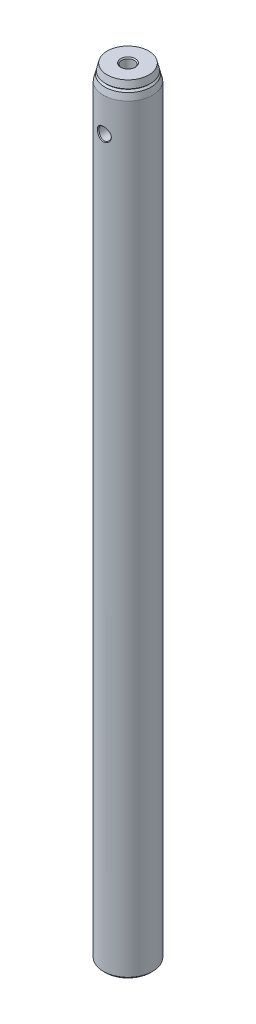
ISO-10303-21;
HEADER;
FILE_DESCRIPTION(('STEP AP214'),'2;1');
FILE_NAME('part.step','',(''),(''),'','','');
FILE_SCHEMA(('AUTOMOTIVE_DESIGN { 1 0 10303 214 1 1 1 1 }'));
ENDSEC;
DATA;
#1=APPLICATION_CONTEXT('core data for automotive mechanical design processes');
#2=APPLICATION_PROTOCOL_DEFINITION('international standard','automotive_design',2000,#1);
#3=PRODUCT_CONTEXT('',#1,'mechanical');
#4=PRODUCT('Part','Part','',(#3));
#5=PRODUCT_RELATED_PRODUCT_CATEGORY('part','',(#4));
#6=PRODUCT_DEFINITION_FORMATION('','',#4);
#7=PRODUCT_DEFINITION_CONTEXT('part definition',#1,'design');
#8=PRODUCT_DEFINITION('design','',#6,#7);
#9=PRODUCT_DEFINITION_SHAPE('','',#8);
#10=(LENGTH_UNIT() NAMED_UNIT(*) SI_UNIT(.MILLI.,.METRE.));
#11=(NAMED_UNIT(*) PLANE_ANGLE_UNIT() SI_UNIT($,.RADIAN.));
#12=(NAMED_UNIT(*) SI_UNIT($,.STERADIAN.) SOLID_ANGLE_UNIT());
#13=UNCERTAINTY_MEASURE_WITH_UNIT(LENGTH_MEASURE(1.E-05),#10,'distance_accuracy_value','');
#14=(GEOMETRIC_REPRESENTATION_CONTEXT(3) GLOBAL_UNCERTAINTY_ASSIGNED_CONTEXT((#13)) GLOBAL_UNIT_ASSIGNED_CONTEXT((#10,
#11,#12)) REPRESENTATION_CONTEXT('',''));
#15=CARTESIAN_POINT('',(0.,0.,0.));
#16=DIRECTION('',(0.,0.,1.));
#17=DIRECTION('',(1.,0.,0.));
#18=AXIS2_PLACEMENT_3D('',#15,#16,#17);
#19=CARTESIAN_POINT('',(0.,199.9996,0.));
#20=DIRECTION('',(0.,-1.,0.));
#21=DIRECTION('',(0.,0.,-1.));
#22=AXIS2_PLACEMENT_3D('',#19,#20,#21);
#23=PLANE('',#22);
#24=CARTESIAN_POINT('',(0.,199.9996,0.));
#25=DIRECTION('',(0.,-1.,0.));
#26=DIRECTION('',(0.,0.,-1.));
#27=AXIS2_PLACEMENT_3D('',#24,#25,#26);
#28=CIRCLE('',#27,1.90399999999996);
#29=CARTESIAN_POINT('',(0.,199.9996,-1.90399999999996));
#30=VERTEX_POINT('',#29);
#31=EDGE_CURVE('E11',#30,#30,#28,.T.);
#32=ORIENTED_EDGE('',*,*,#31,.T.);
#33=EDGE_LOOP('',(#32));
#34=FACE_BOUND('',#33,.T.);
#35=CARTESIAN_POINT('',(0.,199.9996,0.));
#36=DIRECTION('',(0.,1.,0.));
#37=DIRECTION('',(0.,0.,1.));
#38=AXIS2_PLACEMENT_3D('',#35,#36,#37);
#39=CIRCLE('',#38,5.34669999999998);
#40=CARTESIAN_POINT('',(0.,199.9996,5.34669999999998));
#41=VERTEX_POINT('',#40);
#42=EDGE_CURVE('E64',#41,#41,#39,.T.);
#43=ORIENTED_EDGE('',*,*,#42,.T.);
#44=EDGE_LOOP('',(#43));
#45=FACE_BOUND('',#44,.T.);
#46=ADVANCED_FACE('F17',(#34,#45),#23,.F.);
#47=CARTESIAN_POINT('',(0.,198.289290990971,0.));
#48=DIRECTION('',(0.,-1.,0.));
#49=DIRECTION('',(0.,0.,-1.));
#50=AXIS2_PLACEMENT_3D('',#47,#48,#49);
#51=CONICAL_SURFACE('',#50,5.76886488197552,0.24199804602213);
#52=ORIENTED_EDGE('',*,*,#42,.F.);
#53=EDGE_LOOP('',(#52));
#54=FACE_BOUND('',#53,.T.);
#55=CARTESIAN_POINT('',(0.,198.289290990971,0.));
#56=DIRECTION('',(0.,1.,0.));
#57=DIRECTION('',(0.,0.,1.));
#58=AXIS2_PLACEMENT_3D('',#55,#56,#57);
#59=CIRCLE('',#58,5.76886488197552);
#60=CARTESIAN_POINT('',(0.,198.289290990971,5.76886488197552));
#61=VERTEX_POINT('',#60);
#62=EDGE_CURVE('E61',#61,#61,#59,.T.);
#63=ORIENTED_EDGE('',*,*,#62,.T.);
#64=EDGE_LOOP('',(#63));
#65=FACE_BOUND('',#64,.T.);
#66=ADVANCED_FACE('F216',(#54,#65),#51,.T.);
#67=CARTESIAN_POINT('',(0.,198.00062,0.));
#68=DIRECTION('',(0.,1.,0.));
#69=DIRECTION('',(0.,0.,1.));
#70=AXIS2_PLACEMENT_3D('',#67,#68,#69);
#71=CONICAL_SURFACE('',#70,5.49909999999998,0.751555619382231);
#72=ORIENTED_EDGE('',*,*,#62,.F.);
#73=EDGE_LOOP('',(#72));
#74=FACE_BOUND('',#73,.T.);
#75=CARTESIAN_POINT('',(0.,198.00062,0.));
#76=DIRECTION('',(0.,1.,0.));
#77=DIRECTION('',(0.,0.,1.));
#78=AXIS2_PLACEMENT_3D('',#75,#76,#77);
#79=CIRCLE('',#78,5.49909999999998);
#80=CARTESIAN_POINT('',(0.,198.00062,5.49909999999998));
#81=VERTEX_POINT('',#80);
#82=EDGE_CURVE('E58',#81,#81,#79,.T.);
#83=ORIENTED_EDGE('',*,*,#82,.T.);
#84=EDGE_LOOP('',(#83));
#85=FACE_BOUND('',#84,.T.);
#86=ADVANCED_FACE('F223',(#74,#85),#71,.T.);
#87=CARTESIAN_POINT('',(0.,197.586383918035,0.));
#88=DIRECTION('',(0.,-1.,0.));
#89=DIRECTION('',(0.,0.,-1.));
#90=AXIS2_PLACEMENT_3D('',#87,#88,#89);
#91=CONICAL_SURFACE('',#90,5.9423672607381,0.819240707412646);
#92=ORIENTED_EDGE('',*,*,#82,.F.);
#93=EDGE_LOOP('',(#92));
#94=FACE_BOUND('',#93,.T.);
#95=CARTESIAN_POINT('',(0.,197.586383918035,0.));
#96=DIRECTION('',(0.,1.,0.));
#97=DIRECTION('',(0.,0.,1.));
#98=AXIS2_PLACEMENT_3D('',#95,#96,#97);
#99=CIRCLE('',#98,5.9423672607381);
#100=CARTESIAN_POINT('',(0.,197.586383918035,5.9423672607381));
#101=VERTEX_POINT('',#100);
#102=EDGE_CURVE('E55',#101,#101,#99,.T.);
#103=ORIENTED_EDGE('',*,*,#102,.T.);
#104=EDGE_LOOP('',(#103));
#105=FACE_BOUND('',#104,.T.);
#106=ADVANCED_FACE('F232',(#94,#105),#91,.T.);
#107=CARTESIAN_POINT('',(0.,195.9864,0.));
#108=DIRECTION('',(0.,-1.,0.));
#109=DIRECTION('',(0.,0.,-1.));
#110=AXIS2_PLACEMENT_3D('',#107,#108,#109);
#111=CONICAL_SURFACE('',#110,6.33729999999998,0.241998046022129);
#112=ORIENTED_EDGE('',*,*,#102,.F.);
#113=EDGE_LOOP('',(#112));
#114=FACE_BOUND('',#113,.T.);
#115=CARTESIAN_POINT('',(0.,195.9864,0.));
#116=DIRECTION('',(0.,1.,0.));
#117=DIRECTION('',(0.,0.,1.));
#118=AXIS2_PLACEMENT_3D('',#115,#116,#117);
#119=CIRCLE('',#118,6.33729999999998);
#120=CARTESIAN_POINT('',(0.,195.9864,6.33729999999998));
#121=VERTEX_POINT('',#120);
#122=EDGE_CURVE('E52',#121,#121,#119,.T.);
#123=ORIENTED_EDGE('',*,*,#122,.T.);
#124=EDGE_LOOP('',(#123));
#125=FACE_BOUND('',#124,.T.);
#126=ADVANCED_FACE('F89',(#114,#125),#111,.T.);
#127=CARTESIAN_POINT('',(0.,199.9996,0.));
#128=DIRECTION('',(0.,1.,0.));
#129=DIRECTION('',(0.,0.,1.));
#130=AXIS2_PLACEMENT_3D('',#127,#128,#129);
#131=CYLINDRICAL_SURFACE('',#130,6.33729999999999);
#132=CARTESIAN_POINT('',(0.,185.571551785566,6.33729999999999));
#133=CARTESIAN_POINT('',(0.0294399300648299,185.571535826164,6.33730404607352));
#134=CARTESIAN_POINT('',(0.058878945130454,185.572254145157,6.33707764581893));
#135=CARTESIAN_POINT('',(0.117621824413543,185.575134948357,6.33618719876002));
#136=CARTESIAN_POINT('',(0.146925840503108,185.577294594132,6.33552401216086));
#137=CARTESIAN_POINT('',(0.205337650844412,185.583029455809,6.33378438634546));
#138=CARTESIAN_POINT('',(0.234445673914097,185.586602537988,6.33270857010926));
#139=CARTESIAN_POINT('',(0.292405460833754,185.595135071,6.33016829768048));
#140=CARTESIAN_POINT('',(0.321257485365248,185.600092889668,6.32870429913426));
#141=CARTESIAN_POINT('',(0.378645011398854,185.611366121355,6.32541212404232));
#142=CARTESIAN_POINT('',(0.407180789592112,185.617680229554,6.32358429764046));
#143=CARTESIAN_POINT('',(0.463875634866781,185.631637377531,6.31958889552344));
#144=CARTESIAN_POINT('',(0.492034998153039,185.639279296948,6.31742160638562));
#145=CARTESIAN_POINT('',(0.547916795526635,185.655863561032,6.31277166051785));
#146=CARTESIAN_POINT('',(0.575639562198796,185.664804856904,6.31028925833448));
#147=CARTESIAN_POINT('',(0.630587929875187,185.6839594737,6.30503343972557));
#148=CARTESIAN_POINT('',(0.657813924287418,185.694171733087,6.30226026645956));
#149=CARTESIAN_POINT('',(0.711708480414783,185.715839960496,6.29644724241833));
#150=CARTESIAN_POINT('',(0.738377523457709,185.727294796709,6.29340763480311));
#151=CARTESIAN_POINT('',(0.791097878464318,185.751419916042,6.28708605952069));
#152=CARTESIAN_POINT('',(0.817149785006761,185.76408896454,6.28380433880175));
#153=CARTESIAN_POINT('',(0.868575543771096,185.790614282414,6.27702288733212));
#154=CARTESIAN_POINT('',(0.893950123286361,185.804469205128,6.27352340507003));
#155=CARTESIAN_POINT('',(0.943960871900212,185.833338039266,6.26633065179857));
#156=CARTESIAN_POINT('',(0.968597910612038,185.848350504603,6.26263762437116));
#157=CARTESIAN_POINT('',(1.01707325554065,185.879506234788,6.25508249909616));
#158=CARTESIAN_POINT('',(1.04091256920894,185.895647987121,6.25122062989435));
#159=CARTESIAN_POINT('',(1.08773198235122,185.929033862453,6.24335072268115));
#160=CARTESIAN_POINT('',(1.11071320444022,185.946276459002,6.23934289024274));
#161=CARTESIAN_POINT('',(1.15575658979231,185.981836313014,6.2312107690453));
#162=CARTESIAN_POINT('',(1.17781994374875,186.000152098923,6.22708664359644));
#163=CARTESIAN_POINT('',(1.22096551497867,186.037827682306,6.21872632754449));
#164=CARTESIAN_POINT('',(1.24204891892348,186.057186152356,6.21449028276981));
#165=CARTESIAN_POINT('',(1.28317150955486,186.096917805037,6.20600685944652));
#166=CARTESIAN_POINT('',(1.30321223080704,186.117289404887,6.20175950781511));
#167=CARTESIAN_POINT('',(1.3422159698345,186.158988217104,6.19335716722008));
#168=CARTESIAN_POINT('',(1.36118083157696,186.180313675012,6.18920202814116));
#169=CARTESIAN_POINT('',(1.39800144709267,186.223858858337,6.180991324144));
#170=CARTESIAN_POINT('',(1.41585895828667,186.246077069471,6.17693560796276));
#171=CARTESIAN_POINT('',(1.45043566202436,186.291349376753,6.16895620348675));
#172=CARTESIAN_POINT('',(1.467156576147,186.314402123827,6.16503232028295));
#173=CARTESIAN_POINT('',(1.49943021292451,186.361284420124,6.15734229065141));
#174=CARTESIAN_POINT('',(1.51498466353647,186.385112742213,6.15357591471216));
#175=CARTESIAN_POINT('',(1.54489561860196,186.433487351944,6.14622841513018));
#176=CARTESIAN_POINT('',(1.55925388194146,186.458032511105,6.14264702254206));
#177=CARTESIAN_POINT('',(1.58674263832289,186.507781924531,6.13569652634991));
#178=CARTESIAN_POINT('',(1.59987492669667,186.532985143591,6.1323271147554));
#179=CARTESIAN_POINT('',(1.62488191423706,186.583991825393,6.12582774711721));
#180=CARTESIAN_POINT('',(1.63675842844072,186.609794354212,6.12269744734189));
#181=CARTESIAN_POINT('',(1.65922406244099,186.661940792,6.11670343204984));
#182=CARTESIAN_POINT('',(1.66981497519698,186.688283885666,6.11383934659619));
#183=CARTESIAN_POINT('',(1.68967964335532,186.74145257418,6.10840488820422));
#184=CARTESIAN_POINT('',(1.69895509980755,186.768277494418,6.10583413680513));
#185=CARTESIAN_POINT('',(1.71615916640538,186.822350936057,6.10101345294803));
#186=CARTESIAN_POINT('',(1.72408928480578,186.849598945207,6.09876316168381));
#187=CARTESIAN_POINT('',(1.73857307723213,186.904459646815,6.09461047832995));
#188=CARTESIAN_POINT('',(1.74512793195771,186.932072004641,6.09270778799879));
#189=CARTESIAN_POINT('',(1.75683178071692,186.987602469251,6.08927733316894));
#190=CARTESIAN_POINT('',(1.76198145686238,187.015520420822,6.08774938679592));
#191=CARTESIAN_POINT('',(1.77084554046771,187.071603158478,6.08509542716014));
#192=CARTESIAN_POINT('',(1.77455992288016,187.099767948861,6.08396942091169));
#193=CARTESIAN_POINT('',(1.78052484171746,187.156285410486,6.08214612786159));
#194=CARTESIAN_POINT('',(1.78277440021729,187.184638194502,6.08144912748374));
#195=CARTESIAN_POINT('',(1.78577903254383,187.241472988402,6.08051108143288));
#196=CARTESIAN_POINT('',(1.78653189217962,187.269955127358,6.08027071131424));
#197=CARTESIAN_POINT('',(1.78652142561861,187.326919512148,6.08027101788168));
#198=CARTESIAN_POINT('',(1.78575806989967,187.355401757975,6.08051170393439));
#199=CARTESIAN_POINT('',(1.78274505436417,187.412237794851,6.08144750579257));
#200=CARTESIAN_POINT('',(1.78049756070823,187.440591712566,6.08214195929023));
#201=CARTESIAN_POINT('',(1.77454464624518,187.497112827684,6.08395846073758));
#202=CARTESIAN_POINT('',(1.77084019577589,187.525280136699,6.08508022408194));
#203=CARTESIAN_POINT('',(1.76200373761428,187.58136972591,6.08772409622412));
#204=CARTESIAN_POINT('',(1.75687176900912,187.609292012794,6.08924619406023));
#205=CARTESIAN_POINT('',(1.74520976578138,187.664833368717,6.0926637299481));
#206=CARTESIAN_POINT('',(1.73867907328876,187.692452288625,6.09455934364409));
#207=CARTESIAN_POINT('',(1.72424904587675,187.747328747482,6.09869695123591));
#208=CARTESIAN_POINT('',(1.71634855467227,187.774585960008,6.10093923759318));
#209=CARTESIAN_POINT('',(1.6992081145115,187.828680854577,6.1057433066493));
#210=CARTESIAN_POINT('',(1.68996667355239,187.855518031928,6.10830544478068));
#211=CARTESIAN_POINT('',(1.67017337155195,187.908714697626,6.11372238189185));
#212=CARTESIAN_POINT('',(1.65961981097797,187.935073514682,6.1165775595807));
#213=CARTESIAN_POINT('',(1.6372311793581,187.98725528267,6.12255377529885));
#214=CARTESIAN_POINT('',(1.62539429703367,188.013077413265,6.12567518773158));
#215=CARTESIAN_POINT('',(1.60046784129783,188.06412760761,6.13215710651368));
#216=CARTESIAN_POINT('',(1.58737641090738,188.089354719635,6.13551796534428));
#217=CARTESIAN_POINT('',(1.55996960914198,188.139156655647,6.14245199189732));
#218=CARTESIAN_POINT('',(1.54565237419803,188.163730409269,6.14602548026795));
#219=CARTESIAN_POINT('',(1.51582269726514,188.212167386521,6.15335811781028));
#220=CARTESIAN_POINT('',(1.50030840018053,188.236029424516,6.15711755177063));
#221=CARTESIAN_POINT('',(1.46811324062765,188.282984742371,6.16479495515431));
#222=CARTESIAN_POINT('',(1.45143052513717,188.306076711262,6.1687131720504));
#223=CARTESIAN_POINT('',(1.41692747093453,188.351433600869,6.17668281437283));
#224=CARTESIAN_POINT('',(1.39910525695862,188.373697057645,6.18073445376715));
#225=CARTESIAN_POINT('',(1.36235107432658,188.417338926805,6.18893888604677));
#226=CARTESIAN_POINT('',(1.3434171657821,188.438715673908,6.19309184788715));
#227=CARTESIAN_POINT('',(1.30447161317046,188.480525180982,6.20149204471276));
#228=CARTESIAN_POINT('',(1.28445791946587,188.500955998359,6.20573944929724));
#229=CARTESIAN_POINT('',(1.24338256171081,188.540805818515,6.21422472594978));
#230=CARTESIAN_POINT('',(1.22231929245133,188.560223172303,6.21846257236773));
#231=CARTESIAN_POINT('',(1.17920582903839,188.598007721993,6.22682733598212));
#232=CARTESIAN_POINT('',(1.1571545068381,188.616373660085,6.23095411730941));
#233=CARTESIAN_POINT('',(1.11212941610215,188.652027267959,6.23909234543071));
#234=CARTESIAN_POINT('',(1.08915449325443,188.669313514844,6.2431036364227));
#235=CARTESIAN_POINT('',(1.04234247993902,188.702780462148,6.25098116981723));
#236=CARTESIAN_POINT('',(1.01850428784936,188.718959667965,6.25484721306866));
#237=CARTESIAN_POINT('',(0.970027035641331,188.750184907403,6.26241131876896));
#238=CARTESIAN_POINT('',(0.945386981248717,188.765229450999,6.26610915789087));
#239=CARTESIAN_POINT('',(0.895366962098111,188.79415772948,6.27331208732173));
#240=CARTESIAN_POINT('',(0.869986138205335,188.808040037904,6.27681693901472));
#241=CARTESIAN_POINT('',(0.818545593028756,188.834616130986,6.28360960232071));
#242=CARTESIAN_POINT('',(0.792485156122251,188.847308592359,6.28689717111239));
#243=CARTESIAN_POINT('',(0.739746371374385,188.871477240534,6.29323083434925));
#244=CARTESIAN_POINT('',(0.713067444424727,188.882952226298,6.2962766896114));
#245=CARTESIAN_POINT('',(0.659152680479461,188.90465815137,6.30210251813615));
#246=CARTESIAN_POINT('',(0.631916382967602,188.914888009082,6.30488225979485));
#247=CARTESIAN_POINT('',(0.576947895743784,188.934075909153,6.31015143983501));
#248=CARTESIAN_POINT('',(0.549215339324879,188.94303296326,6.31264065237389));
#249=CARTESIAN_POINT('',(0.493315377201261,188.959647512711,6.31730435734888));
#250=CARTESIAN_POINT('',(0.465147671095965,188.967304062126,6.31947862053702));
#251=CARTESIAN_POINT('',(0.40843847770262,188.981289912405,6.32348801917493));
#252=CARTESIAN_POINT('',(0.379896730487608,188.987618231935,6.32532290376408));
#253=CARTESIAN_POINT('',(0.322500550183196,188.998920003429,6.32862915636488));
#254=CARTESIAN_POINT('',(0.29364587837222,189.003892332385,6.33010022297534));
#255=CARTESIAN_POINT('',(0.235684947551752,189.01245464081,6.33265448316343));
#256=CARTESIAN_POINT('',(0.206578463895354,189.016043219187,6.33373728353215));
#257=CARTESIAN_POINT('',(0.14817505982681,189.021810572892,6.3354906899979));
#258=CARTESIAN_POINT('',(0.118877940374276,189.023987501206,6.33616075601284));
#259=CARTESIAN_POINT('',(0.0601542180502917,189.026904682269,6.33706445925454));
#260=CARTESIAN_POINT('',(0.0307274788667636,189.027642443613,6.33729733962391));
#261=CARTESIAN_POINT('',(-0.0281314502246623,189.027653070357,6.33730239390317));
#262=CARTESIAN_POINT('',(-0.057563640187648,189.026925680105,6.33707448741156));
#263=CARTESIAN_POINT('',(-0.116308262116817,189.024027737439,6.33618067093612));
#264=CARTESIAN_POINT('',(-0.145620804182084,189.021859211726,6.33551537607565));
#265=CARTESIAN_POINT('',(-0.20406382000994,189.016108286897,6.33377147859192));
#266=CARTESIAN_POINT('',(-0.233194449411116,189.01252733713,6.33269329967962));
#267=CARTESIAN_POINT('',(-0.291211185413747,189.003980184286,6.33014820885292));
#268=CARTESIAN_POINT('',(-0.32009746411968,188.999015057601,6.32868159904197));
#269=CARTESIAN_POINT('',(-0.377563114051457,188.987728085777,6.32538416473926));
#270=CARTESIAN_POINT('',(-0.406142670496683,188.981407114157,6.32355357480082));
#271=CARTESIAN_POINT('',(-0.462932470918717,188.967436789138,6.3195526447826));
#272=CARTESIAN_POINT('',(-0.491142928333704,188.959788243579,6.31738251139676));
#273=CARTESIAN_POINT('',(-0.547132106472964,188.943190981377,6.31272692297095));
#274=CARTESIAN_POINT('',(-0.574911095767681,188.934243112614,6.31024167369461));
#275=CARTESIAN_POINT('',(-0.629974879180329,188.915075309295,6.3049802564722));
#276=CARTESIAN_POINT('',(-0.657260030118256,188.904856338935,6.30220430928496));
#277=CARTESIAN_POINT('',(-0.71127364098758,188.883174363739,6.29638588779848));
#278=CARTESIAN_POINT('',(-0.738002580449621,188.87171248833,6.29334365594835));
#279=CARTESIAN_POINT('',(-0.790841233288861,188.847572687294,6.28701704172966));
#280=CARTESIAN_POINT('',(-0.816951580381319,188.834896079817,6.28373292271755));
#281=CARTESIAN_POINT('',(-0.868490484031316,188.808354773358,6.27694694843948));
#282=CARTESIAN_POINT('',(-0.893919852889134,188.794491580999,6.27344537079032));
#283=CARTESIAN_POINT('',(-0.944034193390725,188.765605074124,6.26624876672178));
#284=CARTESIAN_POINT('',(-0.968720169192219,188.750583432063,6.26255402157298));
#285=CARTESIAN_POINT('',(-1.01728516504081,188.719407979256,6.25499587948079));
#286=CARTESIAN_POINT('',(-1.04116537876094,188.703255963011,6.25113275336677));
#287=CARTESIAN_POINT('',(-1.0880560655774,188.669847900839,6.2432608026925));
#288=CARTESIAN_POINT('',(-1.11106789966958,188.65259370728,6.23925222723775));
#289=CARTESIAN_POINT('',(-1.15615992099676,188.617008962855,6.23111925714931));
#290=CARTESIAN_POINT('',(-1.17824158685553,188.598680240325,6.22699506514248));
#291=CARTESIAN_POINT('',(-1.22140823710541,188.560976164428,6.21863501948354));
#292=CARTESIAN_POINT('',(-1.24249474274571,188.541602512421,6.21439935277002));
#293=CARTESIAN_POINT('',(-1.28361269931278,188.501836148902,6.20591742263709));
#294=CARTESIAN_POINT('',(-1.30364583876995,188.481445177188,6.2016711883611));
#295=CARTESIAN_POINT('',(-1.34263154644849,188.439703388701,6.19327195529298));
#296=CARTESIAN_POINT('',(-1.36158588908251,188.418354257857,6.1891188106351));
#297=CARTESIAN_POINT('',(-1.39838257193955,188.374757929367,6.18091254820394));
#298=CARTESIAN_POINT('',(-1.41622659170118,188.352512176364,6.17685928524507));
#299=CARTESIAN_POINT('',(-1.45077430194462,188.307182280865,6.16888519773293));
#300=CARTESIAN_POINT('',(-1.46747963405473,188.284099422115,6.16496418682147));
#301=CARTESIAN_POINT('',(-1.49972072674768,188.23715545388,6.15728016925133));
#302=CARTESIAN_POINT('',(-1.51525814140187,188.213295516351,6.15351694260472));
#303=CARTESIAN_POINT('',(-1.54513433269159,188.164857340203,6.14617589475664));
#304=CARTESIAN_POINT('',(-1.5594748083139,188.140280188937,6.14259781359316));
#305=CARTESIAN_POINT('',(-1.5869279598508,188.090467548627,6.13565397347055));
#306=CARTESIAN_POINT('',(-1.60004239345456,188.065233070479,6.13228791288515));
#307=CARTESIAN_POINT('',(-1.62501430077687,188.014165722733,6.12579516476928));
#308=CARTESIAN_POINT('',(-1.6368735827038,187.98833378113,6.12266813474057));
#309=CARTESIAN_POINT('',(-1.65930603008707,187.936131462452,6.11668046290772));
#310=CARTESIAN_POINT('',(-1.66988102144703,187.909761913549,6.11381944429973));
#311=CARTESIAN_POINT('',(-1.68971576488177,187.856544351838,6.10839081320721));
#312=CARTESIAN_POINT('',(-1.6989773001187,187.829697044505,6.1058228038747));
#313=CARTESIAN_POINT('',(-1.71615607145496,187.775583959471,6.10100719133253));
#314=CARTESIAN_POINT('',(-1.72407495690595,187.748318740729,6.09875919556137));
#315=CARTESIAN_POINT('',(-1.73853945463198,187.693429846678,6.0946105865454));
#316=CARTESIAN_POINT('',(-1.74508645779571,187.665806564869,6.0927096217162));
#317=CARTESIAN_POINT('',(-1.75677836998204,187.610261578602,6.08928200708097));
#318=CARTESIAN_POINT('',(-1.76192425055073,187.58234009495,6.08775509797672));
#319=CARTESIAN_POINT('',(-1.77078516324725,187.526258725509,6.08510249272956));
#320=CARTESIAN_POINT('',(-1.77450054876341,187.498098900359,6.08397669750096));
#321=CARTESIAN_POINT('',(-1.78047228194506,187.441600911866,6.08215307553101));
#322=CARTESIAN_POINT('',(-1.78272812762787,187.413262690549,6.08145539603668));
#323=CARTESIAN_POINT('',(-1.78575147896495,187.356467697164,6.08051493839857));
#324=CARTESIAN_POINT('',(-1.78651735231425,187.328010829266,6.0802726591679));
#325=CARTESIAN_POINT('',(-1.7865367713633,187.271102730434,6.08026883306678));
#326=CARTESIAN_POINT('',(-1.78579064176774,187.242651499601,6.08050718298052));
#327=CARTESIAN_POINT('',(-1.78281302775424,187.18587775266,6.08143863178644));
#328=CARTESIAN_POINT('',(-1.78058377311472,187.157555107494,6.08213104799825));
#329=CARTESIAN_POINT('',(-1.77466841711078,187.101096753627,6.0839435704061));
#330=CARTESIAN_POINT('',(-1.77098334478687,187.072960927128,6.08506337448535));
#331=CARTESIAN_POINT('',(-1.76218590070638,187.016934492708,6.087703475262));
#332=CARTESIAN_POINT('',(-1.75707361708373,186.989043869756,6.08922374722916));
#333=CARTESIAN_POINT('',(-1.74545068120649,186.933565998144,6.09263775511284));
#334=CARTESIAN_POINT('',(-1.7389394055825,186.905978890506,6.09453165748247));
#335=CARTESIAN_POINT('',(-1.72454728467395,186.851166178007,6.09866596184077));
#336=CARTESIAN_POINT('',(-1.71666529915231,186.823940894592,6.1009066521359));
#337=CARTESIAN_POINT('',(-1.69956034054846,186.769909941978,6.10570763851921));
#338=CARTESIAN_POINT('',(-1.69033586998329,186.743104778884,6.10826829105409));
#339=CARTESIAN_POINT('',(-1.67057437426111,186.689972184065,6.11368235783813));
#340=CARTESIAN_POINT('',(-1.66003562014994,186.663645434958,6.1165361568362));
#341=CARTESIAN_POINT('',(-1.63767386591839,186.611527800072,6.12250970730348));
#342=CARTESIAN_POINT('',(-1.62584899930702,186.585737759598,6.1256298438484));
#343=CARTESIAN_POINT('',(-1.60094323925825,186.534751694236,6.1321092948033));
#344=CARTESIAN_POINT('',(-1.58786040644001,186.509556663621,6.13546897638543));
#345=CARTESIAN_POINT('',(-1.56046686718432,186.459818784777,6.14240072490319));
#346=CARTESIAN_POINT('',(-1.54615418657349,186.435277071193,6.14597313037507));
#347=CARTESIAN_POINT('',(-1.5163290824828,186.386904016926,6.15330367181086));
#348=CARTESIAN_POINT('',(-1.500814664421,186.363073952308,6.15706211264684));
#349=CARTESIAN_POINT('',(-1.46861415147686,186.3161823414,6.16473759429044));
#350=CARTESIAN_POINT('',(-1.45192603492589,186.293122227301,6.16865490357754));
#351=CARTESIAN_POINT('',(-1.4174063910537,186.247828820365,6.17662278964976));
#352=CARTESIAN_POINT('',(-1.39957279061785,186.22559714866,6.18067360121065));
#353=CARTESIAN_POINT('',(-1.3627897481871,186.18201825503,6.18887643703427));
#354=CARTESIAN_POINT('',(-1.34383814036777,186.160672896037,6.19302864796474));
#355=CARTESIAN_POINT('',(-1.30484939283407,186.118926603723,6.20142739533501));
#356=CARTESIAN_POINT('',(-1.28480994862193,186.098527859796,6.20567411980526));
#357=CARTESIAN_POINT('',(-1.24367802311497,186.058737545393,6.21415825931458));
#358=CARTESIAN_POINT('',(-1.22258362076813,186.039347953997,6.21839564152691));
#359=CARTESIAN_POINT('',(-1.17940611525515,186.001609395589,6.22675999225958));
#360=CARTESIAN_POINT('',(-1.15732157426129,185.983262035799,6.23088678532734));
#361=CARTESIAN_POINT('',(-1.1122276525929,185.947638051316,6.23902550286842));
#362=CARTESIAN_POINT('',(-1.0892168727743,185.930363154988,6.24303723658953));
#363=CARTESIAN_POINT('',(-1.04233151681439,185.896911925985,6.25091606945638));
#364=CARTESIAN_POINT('',(-1.01845565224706,185.880737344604,6.25478293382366));
#365=CARTESIAN_POINT('',(-0.969901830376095,185.849515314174,6.26234904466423));
#366=CARTESIAN_POINT('',(-0.945222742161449,185.834469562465,6.26604803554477));
#367=CARTESIAN_POINT('',(-0.895123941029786,185.805533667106,6.27325357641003));
#368=CARTESIAN_POINT('',(-0.869703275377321,185.791645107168,6.27675986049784));
#369=CARTESIAN_POINT('',(-0.818182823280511,185.765052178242,6.28355564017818));
#370=CARTESIAN_POINT('',(-0.79208226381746,185.752349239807,6.286844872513));
#371=CARTESIAN_POINT('',(-0.739263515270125,185.728156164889,6.29318205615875));
#372=CARTESIAN_POINT('',(-0.712544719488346,185.716667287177,6.29622975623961));
#373=CARTESIAN_POINT('',(-0.65855100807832,185.694930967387,6.30205940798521));
#374=CARTESIAN_POINT('',(-0.631275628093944,185.684684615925,6.30484112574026));
#375=CARTESIAN_POINT('',(-0.576230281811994,185.665461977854,6.31011433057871));
#376=CARTESIAN_POINT('',(-0.548459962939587,185.656486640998,6.31260560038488));
#377=CARTESIAN_POINT('',(-0.492486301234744,185.639834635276,6.31727343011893));
#378=CARTESIAN_POINT('',(-0.464282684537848,185.632158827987,6.31944978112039));
#379=CARTESIAN_POINT('',(-0.407504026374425,185.618134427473,6.32346330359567));
#380=CARTESIAN_POINT('',(-0.378928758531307,185.611786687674,6.32530025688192));
#381=CARTESIAN_POINT('',(-0.321468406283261,185.600446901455,6.32861052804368));
#382=CARTESIAN_POINT('',(-0.292583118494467,185.595455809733,6.33008358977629));
#383=CARTESIAN_POINT('',(-0.234564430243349,185.586857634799,6.33264167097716));
#384=CARTESIAN_POINT('',(-0.205430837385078,185.583251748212,6.33372635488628));
#385=CARTESIAN_POINT('',(-0.146976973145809,185.577452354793,6.335483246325));
#386=CARTESIAN_POINT('',(-0.117656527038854,185.575260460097,6.33615498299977));
#387=CARTESIAN_POINT('',(-0.0588914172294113,185.572316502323,6.33706186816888));
#388=CARTESIAN_POINT('',(-0.0294466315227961,185.571566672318,6.33729633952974));
#389=CARTESIAN_POINT('',(0.,185.571551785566,6.33729999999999));
#390=B_SPLINE_CURVE_WITH_KNOTS('',3,(#132,#133,#134,#135,#136,#137,#138,#139,#140,#141,#142,
#143,#144,#145,#146,#147,#148,#149,#150,#151,#152,#153,#154,#155,#156,#157,#158,#159,#160,#161,
#162,#163,#164,#165,#166,#167,#168,#169,#170,#171,#172,#173,#174,#175,#176,#177,#178,#179,#180,
#181,#182,#183,#184,#185,#186,#187,#188,#189,#190,#191,#192,#193,#194,#195,#196,#197,#198,#199,
#200,#201,#202,#203,#204,#205,#206,#207,#208,#209,#210,#211,#212,#213,#214,#215,#216,#217,#218,
#219,#220,#221,#222,#223,#224,#225,#226,#227,#228,#229,#230,#231,#232,#233,#234,#235,#236,#237,
#238,#239,#240,#241,#242,#243,#244,#245,#246,#247,#248,#249,#250,#251,#252,#253,#254,#255,#256,
#257,#258,#259,#260,#261,#262,#263,#264,#265,#266,#267,#268,#269,#270,#271,#272,#273,#274,#275,
#276,#277,#278,#279,#280,#281,#282,#283,#284,#285,#286,#287,#288,#289,#290,#291,#292,#293,#294,
#295,#296,#297,#298,#299,#300,#301,#302,#303,#304,#305,#306,#307,#308,#309,#310,#311,#312,#313,
#314,#315,#316,#317,#318,#319,#320,#321,#322,#323,#324,#325,#326,#327,#328,#329,#330,#331,#332,
#333,#334,#335,#336,#337,#338,#339,#340,#341,#342,#343,#344,#345,#346,#347,#348,#349,#350,#351,
#352,#353,#354,#355,#356,#357,#358,#359,#360,#361,#362,#363,#364,#365,#366,#367,#368,#369,#370,
#371,#372,#373,#374,#375,#376,#377,#378,#379,#380,#381,#382,#383,#384,#385,#386,#387,#388,#389),
.UNSPECIFIED.,.F.,.F.,(4,2,2,2,2,2,2,2,2,2,2,2,2,2,2,2,2,2,2,2,2,2,2,2,2,2,2,2,2,2,2,2,2,2,2,2,
2,2,2,2,2,2,2,2,2,2,2,2,2,2,2,2,2,2,2,2,2,2,2,2,2,2,2,2,2,2,2,2,2,2,2,2,2,2,2,2,2,2,2,2,2,2,2,2,
2,2,2,2,2,2,2,2,2,2,2,2,2,2,2,2,2,2,2,2,2,2,2,2,2,2,2,2,2,2,2,2,2,2,2,2,2,2,2,2,2,2,2,2,4),(0.,
0.0883078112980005,0.176442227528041,0.264444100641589,0.3523426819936,0.440157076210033,
0.527897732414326,0.615567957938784,0.703165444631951,0.790683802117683,0.87811409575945,
0.965446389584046,1.05267129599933,1.13978153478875,1.22677350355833,1.31364886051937,
1.40041611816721,1.48705183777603,1.5735342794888,1.65987575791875,1.7460834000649,
1.83216070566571,1.91810912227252,2.00392963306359,2.08962435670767,2.17519815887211,
2.26066027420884,2.34602593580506,2.43131800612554,2.51656859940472,2.60182068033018,
2.68712961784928,2.77256466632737,2.85800137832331,2.94331366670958,3.0285692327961,
3.11382246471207,3.19911588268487,3.28448165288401,3.36994314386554,3.4555165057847,
3.5412122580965,3.62703687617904,3.71299437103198,3.79908785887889,3.8853211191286,
3.97170013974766,4.05823464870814,4.14493962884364,4.23178154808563,4.31872527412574,
4.40578126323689,4.49295255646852,4.58023639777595,4.66762584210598,4.75511135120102,
4.84268237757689,4.93032893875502,5.01804318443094,5.10582095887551,5.19366335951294,
5.28157829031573,5.36958200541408,5.45770063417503,5.54597167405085,5.63425811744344,
5.72242066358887,5.81049297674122,5.89849699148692,5.98644447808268,6.07433863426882,
6.16217569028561,6.24994651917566,6.33763824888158,6.42523587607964,6.51272388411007,
6.60008786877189,6.68731617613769,6.77440155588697,6.86134283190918,6.94814658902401,
7.0348066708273,7.12131982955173,7.20769877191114,7.29395042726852,7.38007753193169,
7.46608022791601,7.55195767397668,7.63770966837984,7.72333828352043,7.80884951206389,
7.8942549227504,7.97957332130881,8.06483240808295,8.15007041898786,8.23533773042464,
8.32069840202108,8.40604074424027,8.49125506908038,8.57640926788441,8.66155820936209,
8.74674517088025,8.83200333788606,8.91735734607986,9.00282484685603,9.08841808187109,
9.17414545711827,9.26001311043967,9.34602646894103,9.43219179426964,9.51851771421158,
9.60501673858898,9.6917067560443,9.77856083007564,9.86554539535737,9.95266668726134,
10.039923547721,10.1273090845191,10.2148123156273,10.3024197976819,10.3901172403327,
10.4778911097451,10.5657302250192,10.6536273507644,10.7415807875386,10.8295959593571,
10.9176869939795,11.0058782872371,11.0942060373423),.UNSPECIFIED.);
#391=CARTESIAN_POINT('',(0.,185.571551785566,6.33729999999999));
#392=VERTEX_POINT('',#391);
#393=EDGE_CURVE('E135',#392,#392,#390,.F.);
#394=ORIENTED_EDGE('',*,*,#393,.T.);
#395=EDGE_LOOP('',(#394));
#396=FACE_BOUND('',#395,.T.);
#397=CARTESIAN_POINT('',(0.,189.027648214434,-6.33729999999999));
#398=CARTESIAN_POINT('',(0.0294399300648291,189.027664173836,-6.33730404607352));
#399=CARTESIAN_POINT('',(0.0588789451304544,189.026945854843,-6.33707764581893));
#400=CARTESIAN_POINT('',(0.117621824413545,189.024065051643,-6.33618719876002));
#401=CARTESIAN_POINT('',(0.146925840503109,189.021905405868,-6.33552401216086));
#402=CARTESIAN_POINT('',(0.205337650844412,189.016170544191,-6.33378438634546));
#403=CARTESIAN_POINT('',(0.234445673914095,189.012597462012,-6.33270857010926));
#404=CARTESIAN_POINT('',(0.292405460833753,189.004064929,-6.33016829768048));
#405=CARTESIAN_POINT('',(0.321257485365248,188.999107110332,-6.32870429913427));
#406=CARTESIAN_POINT('',(0.378645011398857,188.987833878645,-6.32541212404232));
#407=CARTESIAN_POINT('',(0.407180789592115,188.981519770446,-6.32358429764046));
#408=CARTESIAN_POINT('',(0.463875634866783,188.967562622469,-6.31958889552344));
#409=CARTESIAN_POINT('',(0.49203499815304,188.959920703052,-6.31742160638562));
#410=CARTESIAN_POINT('',(0.547916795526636,188.943336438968,-6.31277166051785));
#411=CARTESIAN_POINT('',(0.5756395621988,188.934395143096,-6.31028925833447));
#412=CARTESIAN_POINT('',(0.630587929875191,188.9152405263,-6.30503343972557));
#413=CARTESIAN_POINT('',(0.657813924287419,188.905028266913,-6.30226026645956));
#414=CARTESIAN_POINT('',(0.711708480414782,188.883360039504,-6.29644724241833));
#415=CARTESIAN_POINT('',(0.738377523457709,188.871905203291,-6.29340763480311));
#416=CARTESIAN_POINT('',(0.791097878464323,188.847780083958,-6.28708605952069));
#417=CARTESIAN_POINT('',(0.817149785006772,188.83511103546,-6.28380433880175));
#418=CARTESIAN_POINT('',(0.868575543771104,188.808585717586,-6.27702288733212));
#419=CARTESIAN_POINT('',(0.893950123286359,188.794730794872,-6.27352340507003));
#420=CARTESIAN_POINT('',(0.94396087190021,188.765861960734,-6.26633065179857));
#421=CARTESIAN_POINT('',(0.968597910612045,188.750849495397,-6.26263762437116));
#422=CARTESIAN_POINT('',(1.01707325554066,188.719693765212,-6.25508249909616));
#423=CARTESIAN_POINT('',(1.04091256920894,188.703552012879,-6.25122062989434));
#424=CARTESIAN_POINT('',(1.08773198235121,188.670166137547,-6.24335072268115));
#425=CARTESIAN_POINT('',(1.11071320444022,188.652923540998,-6.23934289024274));
#426=CARTESIAN_POINT('',(1.15575658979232,188.617363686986,-6.2312107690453));
#427=CARTESIAN_POINT('',(1.17781994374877,188.599047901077,-6.22708664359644));
#428=CARTESIAN_POINT('',(1.22096551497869,188.561372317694,-6.21872632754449));
#429=CARTESIAN_POINT('',(1.24204891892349,188.542013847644,-6.21449028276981));
#430=CARTESIAN_POINT('',(1.28317150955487,188.502282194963,-6.20600685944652));
#431=CARTESIAN_POINT('',(1.30321223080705,188.481910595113,-6.20175950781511));
#432=CARTESIAN_POINT('',(1.34221596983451,188.440211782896,-6.19335716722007));
#433=CARTESIAN_POINT('',(1.36118083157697,188.418886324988,-6.18920202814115));
#434=CARTESIAN_POINT('',(1.39800144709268,188.375341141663,-6.180991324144));
#435=CARTESIAN_POINT('',(1.41585895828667,188.353122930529,-6.17693560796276));
#436=CARTESIAN_POINT('',(1.45043566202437,188.307850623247,-6.16895620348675));
#437=CARTESIAN_POINT('',(1.46715657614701,188.284797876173,-6.16503232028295));
#438=CARTESIAN_POINT('',(1.49943021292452,188.237915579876,-6.15734229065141));
#439=CARTESIAN_POINT('',(1.51498466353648,188.214087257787,-6.15357591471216));
#440=CARTESIAN_POINT('',(1.54489561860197,188.165712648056,-6.14622841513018));
#441=CARTESIAN_POINT('',(1.55925388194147,188.141167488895,-6.14264702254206));
#442=CARTESIAN_POINT('',(1.5867426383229,188.091418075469,-6.1356965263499));
#443=CARTESIAN_POINT('',(1.59987492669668,188.066214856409,-6.1323271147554));
#444=CARTESIAN_POINT('',(1.62488191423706,188.015208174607,-6.12582774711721));
#445=CARTESIAN_POINT('',(1.63675842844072,187.989405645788,-6.12269744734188));
#446=CARTESIAN_POINT('',(1.65922406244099,187.937259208,-6.11670343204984));
#447=CARTESIAN_POINT('',(1.66981497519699,187.910916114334,-6.11383934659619));
#448=CARTESIAN_POINT('',(1.68967964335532,187.85774742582,-6.10840488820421));
#449=CARTESIAN_POINT('',(1.69895509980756,187.830922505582,-6.10583413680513));
#450=CARTESIAN_POINT('',(1.71615916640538,187.776849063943,-6.10101345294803));
#451=CARTESIAN_POINT('',(1.72408928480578,187.749601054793,-6.09876316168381));
#452=CARTESIAN_POINT('',(1.73857307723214,187.694740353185,-6.09461047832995));
#453=CARTESIAN_POINT('',(1.74512793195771,187.667127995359,-6.09270778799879));
#454=CARTESIAN_POINT('',(1.75683178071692,187.611597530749,-6.08927733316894));
#455=CARTESIAN_POINT('',(1.76198145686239,187.583679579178,-6.08774938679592));
#456=CARTESIAN_POINT('',(1.77084554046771,187.527596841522,-6.08509542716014));
#457=CARTESIAN_POINT('',(1.77455992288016,187.499432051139,-6.08396942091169));
#458=CARTESIAN_POINT('',(1.78052484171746,187.442914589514,-6.08214612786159));
#459=CARTESIAN_POINT('',(1.78277440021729,187.414561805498,-6.08144912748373));
#460=CARTESIAN_POINT('',(1.78577903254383,187.357727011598,-6.08051108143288));
#461=CARTESIAN_POINT('',(1.78653189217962,187.329244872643,-6.08027071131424));
#462=CARTESIAN_POINT('',(1.78652142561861,187.272280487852,-6.08027101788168));
#463=CARTESIAN_POINT('',(1.78575806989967,187.243798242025,-6.08051170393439));
#464=CARTESIAN_POINT('',(1.78274505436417,187.186962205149,-6.08144750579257));
#465=CARTESIAN_POINT('',(1.78049756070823,187.158608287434,-6.08214195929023));
#466=CARTESIAN_POINT('',(1.77454464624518,187.102087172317,-6.08395846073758));
#467=CARTESIAN_POINT('',(1.77084019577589,187.073919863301,-6.08508022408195));
#468=CARTESIAN_POINT('',(1.76200373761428,187.01783027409,-6.08772409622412));
#469=CARTESIAN_POINT('',(1.75687176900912,186.989907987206,-6.08924619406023));
#470=CARTESIAN_POINT('',(1.74520976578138,186.934366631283,-6.0926637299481));
#471=CARTESIAN_POINT('',(1.73867907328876,186.906747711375,-6.09455934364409));
#472=CARTESIAN_POINT('',(1.72424904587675,186.851871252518,-6.09869695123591));
#473=CARTESIAN_POINT('',(1.71634855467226,186.824614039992,-6.10093923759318));
#474=CARTESIAN_POINT('',(1.69920811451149,186.770519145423,-6.10574330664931));
#475=CARTESIAN_POINT('',(1.68996667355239,186.743681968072,-6.10830544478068));
#476=CARTESIAN_POINT('',(1.67017337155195,186.690485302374,-6.11372238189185));
#477=CARTESIAN_POINT('',(1.65961981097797,186.664126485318,-6.1165775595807));
#478=CARTESIAN_POINT('',(1.6372311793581,186.61194471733,-6.12255377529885));
#479=CARTESIAN_POINT('',(1.62539429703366,186.586122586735,-6.12567518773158));
#480=CARTESIAN_POINT('',(1.60046784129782,186.53507239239,-6.13215710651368));
#481=CARTESIAN_POINT('',(1.58737641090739,186.509845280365,-6.13551796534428));
#482=CARTESIAN_POINT('',(1.55996960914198,186.460043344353,-6.14245199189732));
#483=CARTESIAN_POINT('',(1.54565237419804,186.435469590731,-6.14602548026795));
#484=CARTESIAN_POINT('',(1.51582269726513,186.387032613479,-6.15335811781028));
#485=CARTESIAN_POINT('',(1.50030840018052,186.363170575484,-6.15711755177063));
#486=CARTESIAN_POINT('',(1.46811324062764,186.316215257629,-6.16479495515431));
#487=CARTESIAN_POINT('',(1.45143052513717,186.293123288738,-6.1687131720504));
#488=CARTESIAN_POINT('',(1.41692747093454,186.247766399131,-6.17668281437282));
#489=CARTESIAN_POINT('',(1.39910525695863,186.225502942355,-6.18073445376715));
#490=CARTESIAN_POINT('',(1.36235107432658,186.181861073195,-6.18893888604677));
#491=CARTESIAN_POINT('',(1.3434171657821,186.160484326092,-6.19309184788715));
#492=CARTESIAN_POINT('',(1.30447161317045,186.118674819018,-6.20149204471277));
#493=CARTESIAN_POINT('',(1.28445791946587,186.098244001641,-6.20573944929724));
#494=CARTESIAN_POINT('',(1.24338256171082,186.058394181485,-6.21422472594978));
#495=CARTESIAN_POINT('',(1.22231929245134,186.038976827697,-6.21846257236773));
#496=CARTESIAN_POINT('',(1.17920582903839,186.001192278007,-6.22682733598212));
#497=CARTESIAN_POINT('',(1.15715450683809,185.982826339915,-6.23095411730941));
#498=CARTESIAN_POINT('',(1.11212941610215,185.947172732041,-6.23909234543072));
#499=CARTESIAN_POINT('',(1.08915449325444,185.929886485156,-6.2431036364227));
#500=CARTESIAN_POINT('',(1.04234247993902,185.896419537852,-6.25098116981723));
#501=CARTESIAN_POINT('',(1.01850428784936,185.880240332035,-6.25484721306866));
#502=CARTESIAN_POINT('',(0.970027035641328,185.849015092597,-6.26241131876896));
#503=CARTESIAN_POINT('',(0.945386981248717,185.833970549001,-6.26610915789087));
#504=CARTESIAN_POINT('',(0.895366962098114,185.80504227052,-6.27331208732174));
#505=CARTESIAN_POINT('',(0.869986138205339,185.791159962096,-6.27681693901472));
#506=CARTESIAN_POINT('',(0.818545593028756,185.764583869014,-6.28360960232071));
#507=CARTESIAN_POINT('',(0.792485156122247,185.751891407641,-6.2868971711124));
#508=CARTESIAN_POINT('',(0.739746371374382,185.727722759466,-6.29323083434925));
#509=CARTESIAN_POINT('',(0.713067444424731,185.716247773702,-6.2962766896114));
#510=CARTESIAN_POINT('',(0.659152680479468,185.69454184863,-6.30210251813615));
#511=CARTESIAN_POINT('',(0.631916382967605,185.684311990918,-6.30488225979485));
#512=CARTESIAN_POINT('',(0.576947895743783,185.665124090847,-6.31015143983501));
#513=CARTESIAN_POINT('',(0.54921533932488,185.65616703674,-6.31264065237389));
#514=CARTESIAN_POINT('',(0.493315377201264,185.639552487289,-6.31730435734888));
#515=CARTESIAN_POINT('',(0.465147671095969,185.631895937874,-6.31947862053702));
#516=CARTESIAN_POINT('',(0.408438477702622,185.617910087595,-6.32348801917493));
#517=CARTESIAN_POINT('',(0.379896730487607,185.611581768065,-6.32532290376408));
#518=CARTESIAN_POINT('',(0.322500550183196,185.600279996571,-6.32862915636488));
#519=CARTESIAN_POINT('',(0.293645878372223,185.595307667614,-6.33010022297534));
#520=CARTESIAN_POINT('',(0.235684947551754,185.58674535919,-6.33265448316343));
#521=CARTESIAN_POINT('',(0.206578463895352,185.583156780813,-6.33373728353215));
#522=CARTESIAN_POINT('',(0.148175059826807,185.577389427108,-6.3354906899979));
#523=CARTESIAN_POINT('',(0.118877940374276,185.575212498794,-6.33616075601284));
#524=CARTESIAN_POINT('',(0.0601542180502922,185.572295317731,-6.33706445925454));
#525=CARTESIAN_POINT('',(0.0307274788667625,185.571557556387,-6.33729733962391));
#526=CARTESIAN_POINT('',(-0.0281314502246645,185.571546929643,-6.33730239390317));
#527=CARTESIAN_POINT('',(-0.0575636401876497,185.572274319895,-6.33707448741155));
#528=CARTESIAN_POINT('',(-0.116308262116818,185.575172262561,-6.33618067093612));
#529=CARTESIAN_POINT('',(-0.145620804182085,185.577340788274,-6.33551537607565));
#530=CARTESIAN_POINT('',(-0.204063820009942,185.583091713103,-6.33377147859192));
#531=CARTESIAN_POINT('',(-0.233194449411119,185.58667266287,-6.33269329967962));
#532=CARTESIAN_POINT('',(-0.29121118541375,185.595219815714,-6.33014820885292));
#533=CARTESIAN_POINT('',(-0.320097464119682,185.600184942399,-6.32868159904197));
#534=CARTESIAN_POINT('',(-0.37756311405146,185.611471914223,-6.32538416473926));
#535=CARTESIAN_POINT('',(-0.406142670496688,185.617792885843,-6.32355357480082));
#536=CARTESIAN_POINT('',(-0.46293247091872,185.631763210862,-6.3195526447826));
#537=CARTESIAN_POINT('',(-0.491142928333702,185.639411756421,-6.31738251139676));
#538=CARTESIAN_POINT('',(-0.54713210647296,185.656009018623,-6.31272692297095));
#539=CARTESIAN_POINT('',(-0.574911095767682,185.664956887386,-6.31024167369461));
#540=CARTESIAN_POINT('',(-0.62997487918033,185.684124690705,-6.3049802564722));
#541=CARTESIAN_POINT('',(-0.657260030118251,185.694343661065,-6.30220430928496));
#542=CARTESIAN_POINT('',(-0.711273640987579,185.716025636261,-6.29638588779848));
#543=CARTESIAN_POINT('',(-0.738002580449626,185.72748751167,-6.29334365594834));
#544=CARTESIAN_POINT('',(-0.790841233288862,185.751627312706,-6.28701704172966));
#545=CARTESIAN_POINT('',(-0.816951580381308,185.764303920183,-6.28373292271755));
#546=CARTESIAN_POINT('',(-0.868490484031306,185.790845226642,-6.27694694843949));
#547=CARTESIAN_POINT('',(-0.893919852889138,185.804708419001,-6.27344537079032));
#548=CARTESIAN_POINT('',(-0.944034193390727,185.833594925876,-6.26624876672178));
#549=CARTESIAN_POINT('',(-0.968720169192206,185.848616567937,-6.26255402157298));
#550=CARTESIAN_POINT('',(-1.0172851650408,185.879792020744,-6.25499587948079));
#551=CARTESIAN_POINT('',(-1.04116537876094,185.895944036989,-6.25113275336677));
#552=CARTESIAN_POINT('',(-1.08805606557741,185.929352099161,-6.2432608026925));
#553=CARTESIAN_POINT('',(-1.11106789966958,185.94660629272,-6.23925222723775));
#554=CARTESIAN_POINT('',(-1.15615992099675,185.982191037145,-6.23111925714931));
#555=CARTESIAN_POINT('',(-1.17824158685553,186.000519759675,-6.22699506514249));
#556=CARTESIAN_POINT('',(-1.22140823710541,186.038223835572,-6.21863501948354));
#557=CARTESIAN_POINT('',(-1.24249474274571,186.057597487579,-6.21439935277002));
#558=CARTESIAN_POINT('',(-1.28361269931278,186.097363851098,-6.20591742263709));
#559=CARTESIAN_POINT('',(-1.30364583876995,186.117754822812,-6.2016711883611));
#560=CARTESIAN_POINT('',(-1.34263154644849,186.159496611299,-6.19327195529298));
#561=CARTESIAN_POINT('',(-1.36158588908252,186.180845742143,-6.18911881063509));
#562=CARTESIAN_POINT('',(-1.39838257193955,186.224442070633,-6.18091254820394));
#563=CARTESIAN_POINT('',(-1.41622659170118,186.246687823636,-6.17685928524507));
#564=CARTESIAN_POINT('',(-1.45077430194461,186.292017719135,-6.16888519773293));
#565=CARTESIAN_POINT('',(-1.46747963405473,186.315100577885,-6.16496418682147));
#566=CARTESIAN_POINT('',(-1.49972072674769,186.36204454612,-6.15728016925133));
#567=CARTESIAN_POINT('',(-1.51525814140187,186.385904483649,-6.15351694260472));
#568=CARTESIAN_POINT('',(-1.54513433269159,186.434342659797,-6.14617589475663));
#569=CARTESIAN_POINT('',(-1.5594748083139,186.458919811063,-6.14259781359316));
#570=CARTESIAN_POINT('',(-1.5869279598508,186.508732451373,-6.13565397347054));
#571=CARTESIAN_POINT('',(-1.60004239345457,186.533966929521,-6.13228791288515));
#572=CARTESIAN_POINT('',(-1.62501430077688,186.585034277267,-6.12579516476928));
#573=CARTESIAN_POINT('',(-1.6368735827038,186.61086621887,-6.12266813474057));
#574=CARTESIAN_POINT('',(-1.65930603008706,186.663068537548,-6.11668046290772));
#575=CARTESIAN_POINT('',(-1.66988102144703,186.689438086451,-6.11381944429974));
#576=CARTESIAN_POINT('',(-1.68971576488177,186.742655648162,-6.10839081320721));
#577=CARTESIAN_POINT('',(-1.69897730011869,186.769502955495,-6.1058228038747));
#578=CARTESIAN_POINT('',(-1.71615607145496,186.823616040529,-6.10100719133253));
#579=CARTESIAN_POINT('',(-1.72407495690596,186.850881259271,-6.09875919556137));
#580=CARTESIAN_POINT('',(-1.73853945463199,186.905770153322,-6.0946105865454));
#581=CARTESIAN_POINT('',(-1.74508645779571,186.933393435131,-6.0927096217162));
#582=CARTESIAN_POINT('',(-1.75677836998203,186.988938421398,-6.08928200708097));
#583=CARTESIAN_POINT('',(-1.76192425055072,187.01685990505,-6.08775509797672));
#584=CARTESIAN_POINT('',(-1.77078516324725,187.072941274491,-6.08510249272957));
#585=CARTESIAN_POINT('',(-1.77450054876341,187.101101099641,-6.08397669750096));
#586=CARTESIAN_POINT('',(-1.78047228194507,187.157599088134,-6.08215307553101));
#587=CARTESIAN_POINT('',(-1.78272812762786,187.185937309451,-6.08145539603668));
#588=CARTESIAN_POINT('',(-1.78575147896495,187.242732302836,-6.08051493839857));
#589=CARTESIAN_POINT('',(-1.78651735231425,187.271189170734,-6.0802726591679));
#590=CARTESIAN_POINT('',(-1.7865367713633,187.328097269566,-6.08026883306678));
#591=CARTESIAN_POINT('',(-1.78579064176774,187.356548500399,-6.08050718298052));
#592=CARTESIAN_POINT('',(-1.78281302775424,187.41332224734,-6.08143863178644));
#593=CARTESIAN_POINT('',(-1.78058377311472,187.441644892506,-6.08213104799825));
#594=CARTESIAN_POINT('',(-1.77466841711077,187.498103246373,-6.0839435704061));
#595=CARTESIAN_POINT('',(-1.77098334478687,187.526239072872,-6.08506337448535));
#596=CARTESIAN_POINT('',(-1.76218590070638,187.582265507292,-6.087703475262));
#597=CARTESIAN_POINT('',(-1.75707361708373,187.610156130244,-6.08922374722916));
#598=CARTESIAN_POINT('',(-1.74545068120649,187.665634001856,-6.09263775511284));
#599=CARTESIAN_POINT('',(-1.7389394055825,187.693221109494,-6.09453165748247));
#600=CARTESIAN_POINT('',(-1.72454728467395,187.748033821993,-6.09866596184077));
#601=CARTESIAN_POINT('',(-1.71666529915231,187.775259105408,-6.1009066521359));
#602=CARTESIAN_POINT('',(-1.69956034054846,187.829290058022,-6.10570763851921));
#603=CARTESIAN_POINT('',(-1.6903358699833,187.856095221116,-6.10826829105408));
#604=CARTESIAN_POINT('',(-1.67057437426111,187.909227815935,-6.11368235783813));
#605=CARTESIAN_POINT('',(-1.66003562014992,187.935554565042,-6.11653615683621));
#606=CARTESIAN_POINT('',(-1.63767386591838,187.987672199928,-6.12250970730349));
#607=CARTESIAN_POINT('',(-1.62584899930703,188.013462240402,-6.1256298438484));
#608=CARTESIAN_POINT('',(-1.60094323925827,188.064448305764,-6.1321092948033));
#609=CARTESIAN_POINT('',(-1.58786040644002,188.089643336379,-6.13546897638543));
#610=CARTESIAN_POINT('',(-1.56046686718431,188.139381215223,-6.14240072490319));
#611=CARTESIAN_POINT('',(-1.54615418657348,188.163922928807,-6.14597313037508));
#612=CARTESIAN_POINT('',(-1.51632908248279,188.212295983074,-6.15330367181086));
#613=CARTESIAN_POINT('',(-1.500814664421,188.236126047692,-6.15706211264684));
#614=CARTESIAN_POINT('',(-1.46861415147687,188.2830176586,-6.16473759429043));
#615=CARTESIAN_POINT('',(-1.4519260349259,188.306077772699,-6.16865490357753));
#616=CARTESIAN_POINT('',(-1.4174063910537,188.351371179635,-6.17662278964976));
#617=CARTESIAN_POINT('',(-1.39957279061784,188.37360285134,-6.18067360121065));
#618=CARTESIAN_POINT('',(-1.3627897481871,188.41718174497,-6.18887643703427));
#619=CARTESIAN_POINT('',(-1.34383814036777,188.438527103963,-6.19302864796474));
#620=CARTESIAN_POINT('',(-1.30484939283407,188.480273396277,-6.20142739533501));
#621=CARTESIAN_POINT('',(-1.28480994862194,188.500672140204,-6.20567411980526));
#622=CARTESIAN_POINT('',(-1.24367802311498,188.540462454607,-6.21415825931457));
#623=CARTESIAN_POINT('',(-1.22258362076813,188.559852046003,-6.21839564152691));
#624=CARTESIAN_POINT('',(-1.17940611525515,188.597590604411,-6.22675999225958));
#625=CARTESIAN_POINT('',(-1.1573215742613,188.615937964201,-6.23088678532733));
#626=CARTESIAN_POINT('',(-1.11222765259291,188.651561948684,-6.23902550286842));
#627=CARTESIAN_POINT('',(-1.08921687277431,188.668836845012,-6.24303723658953));
#628=CARTESIAN_POINT('',(-1.04233151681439,188.702288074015,-6.25091606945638));
#629=CARTESIAN_POINT('',(-1.01845565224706,188.718462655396,-6.25478293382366));
#630=CARTESIAN_POINT('',(-0.969901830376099,188.749684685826,-6.26234904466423));
#631=CARTESIAN_POINT('',(-0.945222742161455,188.764730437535,-6.26604803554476));
#632=CARTESIAN_POINT('',(-0.895123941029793,188.793666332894,-6.27325357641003));
#633=CARTESIAN_POINT('',(-0.869703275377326,188.807554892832,-6.27675986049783));
#634=CARTESIAN_POINT('',(-0.818182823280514,188.834147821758,-6.28355564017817));
#635=CARTESIAN_POINT('',(-0.792082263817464,188.846850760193,-6.28684487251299));
#636=CARTESIAN_POINT('',(-0.739263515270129,188.871043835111,-6.29318205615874));
#637=CARTESIAN_POINT('',(-0.71254471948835,188.882532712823,-6.29622975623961));
#638=CARTESIAN_POINT('',(-0.658551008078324,188.904269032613,-6.30205940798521));
#639=CARTESIAN_POINT('',(-0.631275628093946,188.914515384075,-6.30484112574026));
#640=CARTESIAN_POINT('',(-0.576230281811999,188.933738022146,-6.31011433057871));
#641=CARTESIAN_POINT('',(-0.548459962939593,188.942713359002,-6.31260560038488));
#642=CARTESIAN_POINT('',(-0.492486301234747,188.959365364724,-6.31727343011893));
#643=CARTESIAN_POINT('',(-0.464282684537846,188.967041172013,-6.31944978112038));
#644=CARTESIAN_POINT('',(-0.407504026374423,188.981065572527,-6.32346330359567));
#645=CARTESIAN_POINT('',(-0.378928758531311,188.987413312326,-6.32530025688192));
#646=CARTESIAN_POINT('',(-0.321468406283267,188.998753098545,-6.32861052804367));
#647=CARTESIAN_POINT('',(-0.292583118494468,189.003744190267,-6.33008358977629));
#648=CARTESIAN_POINT('',(-0.234564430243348,189.012342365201,-6.33264167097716));
#649=CARTESIAN_POINT('',(-0.205430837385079,189.015948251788,-6.33372635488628));
#650=CARTESIAN_POINT('',(-0.146976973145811,189.021747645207,-6.335483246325));
#651=CARTESIAN_POINT('',(-0.117656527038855,189.023939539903,-6.33615498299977));
#652=CARTESIAN_POINT('',(-0.0588914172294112,189.026883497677,-6.33706186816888));
#653=CARTESIAN_POINT('',(-0.0294466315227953,189.027633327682,-6.33729633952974));
#654=CARTESIAN_POINT('',(0.,189.027648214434,-6.33729999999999));
#655=B_SPLINE_CURVE_WITH_KNOTS('',3,(#397,#398,#399,#400,#401,#402,#403,#404,#405,#406,#407,
#408,#409,#410,#411,#412,#413,#414,#415,#416,#417,#418,#419,#420,#421,#422,#423,#424,#425,#426,
#427,#428,#429,#430,#431,#432,#433,#434,#435,#436,#437,#438,#439,#440,#441,#442,#443,#444,#445,
#446,#447,#448,#449,#450,#451,#452,#453,#454,#455,#456,#457,#458,#459,#460,#461,#462,#463,#464,
#465,#466,#467,#468,#469,#470,#471,#472,#473,#474,#475,#476,#477,#478,#479,#480,#481,#482,#483,
#484,#485,#486,#487,#488,#489,#490,#491,#492,#493,#494,#495,#496,#497,#498,#499,#500,#501,#502,
#503,#504,#505,#506,#507,#508,#509,#510,#511,#512,#513,#514,#515,#516,#517,#518,#519,#520,#521,
#522,#523,#524,#525,#526,#527,#528,#529,#530,#531,#532,#533,#534,#535,#536,#537,#538,#539,#540,
#541,#542,#543,#544,#545,#546,#547,#548,#549,#550,#551,#552,#553,#554,#555,#556,#557,#558,#559,
#560,#561,#562,#563,#564,#565,#566,#567,#568,#569,#570,#571,#572,#573,#574,#575,#576,#577,#578,
#579,#580,#581,#582,#583,#584,#585,#586,#587,#588,#589,#590,#591,#592,#593,#594,#595,#596,#597,
#598,#599,#600,#601,#602,#603,#604,#605,#606,#607,#608,#609,#610,#611,#612,#613,#614,#615,#616,
#617,#618,#619,#620,#621,#622,#623,#624,#625,#626,#627,#628,#629,#630,#631,#632,#633,#634,#635,
#636,#637,#638,#639,#640,#641,#642,#643,#644,#645,#646,#647,#648,#649,#650,#651,#652,#653,#654),
.UNSPECIFIED.,.F.,.F.,(4,2,2,2,2,2,2,2,2,2,2,2,2,2,2,2,2,2,2,2,2,2,2,2,2,2,2,2,2,2,2,2,2,2,2,2,
2,2,2,2,2,2,2,2,2,2,2,2,2,2,2,2,2,2,2,2,2,2,2,2,2,2,2,2,2,2,2,2,2,2,2,2,2,2,2,2,2,2,2,2,2,2,2,2,
2,2,2,2,2,2,2,2,2,2,2,2,2,2,2,2,2,2,2,2,2,2,2,2,2,2,2,2,2,2,2,2,2,2,2,2,2,2,2,2,2,2,2,2,4),(0.,
0.0883078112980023,0.176442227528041,0.264444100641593,0.352342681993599,0.440157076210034,
0.527897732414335,0.615567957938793,0.703165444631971,0.790683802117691,0.878114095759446,
0.965446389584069,1.05267129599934,1.13978153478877,1.22677350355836,1.31364886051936,
1.40041611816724,1.48705183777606,1.57353427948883,1.65987575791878,1.74608340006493,
1.83216070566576,1.91810912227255,2.00392963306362,2.0896243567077,2.17519815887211,
2.26066027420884,2.34602593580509,2.43131800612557,2.51656859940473,2.60182068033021,
2.68712961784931,2.77256466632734,2.85800137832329,2.94331366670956,3.02856923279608,
3.11382246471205,3.19911588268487,3.28448165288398,3.36994314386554,3.45551650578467,
3.54121225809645,3.62703687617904,3.71299437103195,3.79908785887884,3.88532111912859,
3.97170013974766,4.05823464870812,4.14493962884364,4.23178154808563,4.31872527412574,
4.4057812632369,4.49295255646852,4.58023639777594,4.66762584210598,4.75511135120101,
4.84268237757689,4.93032893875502,5.01804318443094,5.10582095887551,5.19366335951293,
5.28157829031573,5.36958200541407,5.45770063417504,5.54597167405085,5.63425811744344,
5.72242066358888,5.81049297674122,5.89849699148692,5.98644447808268,6.07433863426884,
6.16217569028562,6.24994651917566,6.33763824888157,6.42523587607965,6.51272388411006,
6.60008786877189,6.68731617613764,6.77440155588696,6.86134283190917,6.948146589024,
7.03480667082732,7.12131982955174,7.20769877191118,7.29395042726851,7.38007753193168,
7.46608022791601,7.55195767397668,7.63770966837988,7.72333828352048,7.80884951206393,
7.89425492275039,7.97957332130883,8.06483240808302,8.15007041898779,8.23533773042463,
8.32069840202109,8.40604074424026,8.49125506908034,8.57640926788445,8.66155820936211,
8.74674517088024,8.83200333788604,8.91735734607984,9.00282484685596,9.08841808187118,
9.17414545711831,9.26001311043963,9.34602646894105,9.43219179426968,9.51851771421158,
9.60501673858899,9.69170675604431,9.77856083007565,9.8655453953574,9.95266668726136,
10.039923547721,10.1273090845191,10.2148123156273,10.3024197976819,10.3901172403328,
10.4778911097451,10.5657302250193,10.6536273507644,10.7415807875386,10.8295959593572,
10.9176869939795,11.0058782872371,11.0942060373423),.UNSPECIFIED.);
#656=CARTESIAN_POINT('',(0.,189.027648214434,-6.33729999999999));
#657=VERTEX_POINT('',#656);
#658=EDGE_CURVE('E67',#657,#657,#655,.F.);
#659=ORIENTED_EDGE('',*,*,#658,.T.);
#660=EDGE_LOOP('',(#659));
#661=FACE_BOUND('',#660,.T.);
#662=ORIENTED_EDGE('',*,*,#122,.F.);
#663=EDGE_LOOP('',(#662));
#664=FACE_BOUND('',#663,.T.);
#665=CARTESIAN_POINT('',(0.,0.508000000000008,0.));
#666=DIRECTION('',(0.,1.,0.));
#667=DIRECTION('',(0.,0.,1.));
#668=AXIS2_PLACEMENT_3D('',#665,#666,#667);
#669=CIRCLE('',#668,6.3373);
#670=CARTESIAN_POINT('',(0.,0.508000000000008,6.3373));
#671=VERTEX_POINT('',#670);
#672=EDGE_CURVE('E49',#671,#671,#669,.T.);
#673=ORIENTED_EDGE('',*,*,#672,.T.);
#674=EDGE_LOOP('',(#673));
#675=FACE_BOUND('',#674,.T.);
#676=ADVANCED_FACE('F78',(#396,#661,#664,#675),#131,.T.);
#677=CARTESIAN_POINT('',(0.,0.,0.));
#678=DIRECTION('',(0.,1.,0.));
#679=DIRECTION('',(0.,0.,1.));
#680=AXIS2_PLACEMENT_3D('',#677,#678,#679);
#681=CONICAL_SURFACE('',#680,5.8293,0.78539816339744);
#682=ORIENTED_EDGE('',*,*,#672,.F.);
#683=EDGE_LOOP('',(#682));
#684=FACE_BOUND('',#683,.T.);
#685=CARTESIAN_POINT('',(0.,0.,0.));
#686=DIRECTION('',(0.,1.,0.));
#687=DIRECTION('',(0.,0.,1.));
#688=AXIS2_PLACEMENT_3D('',#685,#686,#687);
#689=CIRCLE('',#688,5.8293);
#690=CARTESIAN_POINT('',(0.,0.,5.8293));
#691=VERTEX_POINT('',#690);
#692=EDGE_CURVE('E44',#691,#691,#689,.T.);
#693=ORIENTED_EDGE('',*,*,#692,.T.);
#694=EDGE_LOOP('',(#693));
#695=FACE_BOUND('',#694,.T.);
#696=ADVANCED_FACE('F88',(#684,#695),#681,.T.);
#697=CARTESIAN_POINT('',(5.82930000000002,0.,0.));
#698=DIRECTION('',(0.,1.,0.));
#699=DIRECTION('',(0.,0.,1.));
#700=AXIS2_PLACEMENT_3D('',#697,#698,#699);
#701=PLANE('',#700);
#702=CARTESIAN_POINT('',(0.,0.,0.));
#703=DIRECTION('',(0.,1.,0.));
#704=DIRECTION('',(0.,0.,1.));
#705=AXIS2_PLACEMENT_3D('',#702,#703,#704);
#706=CIRCLE('',#705,3.00800000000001);
#707=CARTESIAN_POINT('',(0.,0.,3.00800000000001));
#708=VERTEX_POINT('',#707);
#709=EDGE_CURVE('E196',#708,#708,#706,.T.);
#710=ORIENTED_EDGE('',*,*,#709,.T.);
#711=EDGE_LOOP('',(#710));
#712=FACE_BOUND('',#711,.T.);
#713=ORIENTED_EDGE('',*,*,#692,.F.);
#714=EDGE_LOOP('',(#713));
#715=FACE_BOUND('',#714,.T.);
#716=ADVANCED_FACE('F249',(#712,#715),#701,.F.);
#717=CARTESIAN_POINT('',(0.,199.9996,0.));
#718=DIRECTION('',(0.,1.,0.));
#719=DIRECTION('',(0.,0.,1.));
#720=AXIS2_PLACEMENT_3D('',#717,#718,#719);
#721=CYLINDRICAL_SURFACE('',#720,1.65);
#722=CARTESIAN_POINT('',(0.,199.7456,0.));
#723=DIRECTION('',(0.,-1.,0.));
#724=DIRECTION('',(0.,0.,-1.));
#725=AXIS2_PLACEMENT_3D('',#722,#723,#724);
#726=CIRCLE('',#725,1.65);
#727=CARTESIAN_POINT('',(0.,199.7456,-1.65));
#728=VERTEX_POINT('',#727);
#729=EDGE_CURVE('E25',#728,#728,#726,.F.);
#730=ORIENTED_EDGE('',*,*,#729,.T.);
#731=EDGE_LOOP('',(#730));
#732=FACE_BOUND('',#731,.T.);
#733=CARTESIAN_POINT('',(0.,193.9036,0.));
#734=DIRECTION('',(0.,1.,0.));
#735=DIRECTION('',(0.,0.,1.));
#736=AXIS2_PLACEMENT_3D('',#733,#734,#735);
#737=CIRCLE('',#736,1.65);
#738=CARTESIAN_POINT('',(0.,193.9036,1.65));
#739=VERTEX_POINT('',#738);
#740=EDGE_CURVE('E41',#739,#739,#737,.T.);
#741=ORIENTED_EDGE('',*,*,#740,.F.);
#742=EDGE_LOOP('',(#741));
#743=FACE_BOUND('',#742,.T.);
#744=ADVANCED_FACE('F202',(#732,#743),#721,.F.);
#745=CARTESIAN_POINT('',(0.,193.9036,0.));
#746=DIRECTION('',(0.,1.,0.));
#747=DIRECTION('',(0.,0.,1.));
#748=AXIS2_PLACEMENT_3D('',#745,#746,#747);
#749=CONICAL_SURFACE('',#748,1.65,1.02974425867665);
#750=CARTESIAN_POINT('',(0.,192.912179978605,0.));
#751=VERTEX_POINT('',#750);
#752=VERTEX_LOOP('',#751);
#753=FACE_BOUND('',#752,.T.);
#754=ORIENTED_EDGE('',*,*,#740,.T.);
#755=EDGE_LOOP('',(#754));
#756=FACE_BOUND('',#755,.T.);
#757=ADVANCED_FACE('F258',(#753,#756),#749,.F.);
#758=CARTESIAN_POINT('',(0.,0.,0.));
#759=DIRECTION('',(0.,-1.,0.));
#760=DIRECTION('',(0.,0.,-1.));
#761=AXIS2_PLACEMENT_3D('',#758,#759,#760);
#762=CYLINDRICAL_SURFACE('',#761,2.5);
#763=CARTESIAN_POINT('',(0.,0.508000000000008,0.));
#764=DIRECTION('',(0.,1.,0.));
#765=DIRECTION('',(0.,0.,1.));
#766=AXIS2_PLACEMENT_3D('',#763,#764,#765);
#767=CIRCLE('',#766,2.5);
#768=CARTESIAN_POINT('',(0.,0.508000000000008,2.5));
#769=VERTEX_POINT('',#768);
#770=EDGE_CURVE('E188',#769,#769,#767,.F.);
#771=ORIENTED_EDGE('',*,*,#770,.T.);
#772=EDGE_LOOP('',(#771));
#773=FACE_BOUND('',#772,.T.);
#774=CARTESIAN_POINT('',(0.,10.541,0.));
#775=DIRECTION('',(0.,-1.,0.));
#776=DIRECTION('',(0.,0.,-1.));
#777=AXIS2_PLACEMENT_3D('',#774,#775,#776);
#778=CIRCLE('',#777,2.5);
#779=CARTESIAN_POINT('',(0.,10.541,-2.5));
#780=VERTEX_POINT('',#779);
#781=EDGE_CURVE('E39',#780,#780,#778,.T.);
#782=ORIENTED_EDGE('',*,*,#781,.F.);
#783=EDGE_LOOP('',(#782));
#784=FACE_BOUND('',#783,.T.);
#785=ADVANCED_FACE('F35',(#773,#784),#762,.F.);
#786=CARTESIAN_POINT('',(0.,10.541,0.));
#787=DIRECTION('',(0.,-1.,0.));
#788=DIRECTION('',(0.,0.,-1.));
#789=AXIS2_PLACEMENT_3D('',#786,#787,#788);
#790=CONICAL_SURFACE('',#789,2.5,1.02974425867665);
#791=CARTESIAN_POINT('',(0.,12.0431515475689,0.));
#792=VERTEX_POINT('',#791);
#793=VERTEX_LOOP('',#792);
#794=FACE_BOUND('',#793,.T.);
#795=ORIENTED_EDGE('',*,*,#781,.T.);
#796=EDGE_LOOP('',(#795));
#797=FACE_BOUND('',#796,.T.);
#798=ADVANCED_FACE('F31',(#794,#797),#790,.F.);
#799=CARTESIAN_POINT('',(0.,187.2996,-6.3373));
#800=DIRECTION('',(0.,0.,1.));
#801=DIRECTION('',(1.,0.,0.));
#802=AXIS2_PLACEMENT_3D('',#799,#800,#801);
#803=CYLINDRICAL_SURFACE('',#802,1.5875);
#804=CARTESIAN_POINT('',(0.,185.7121,6.12985953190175));
#805=CARTESIAN_POINT('',(-0.419045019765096,185.712326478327,6.129800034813));
#806=CARTESIAN_POINT('',(-0.83097660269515,185.885476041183,6.07257117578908));
#807=CARTESIAN_POINT('',(-1.41586111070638,186.470435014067,5.94071188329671));
#808=CARTESIAN_POINT('',(-1.58762537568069,186.88092209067,5.88121676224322));
#809=CARTESIAN_POINT('',(-1.5873746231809,187.718192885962,5.88127060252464));
#810=CARTESIAN_POINT('',(-1.41465220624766,188.13004274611,5.94097032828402));
#811=CARTESIAN_POINT('',(-0.830065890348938,188.714567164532,6.07278223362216));
#812=CARTESIAN_POINT('',(-0.417659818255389,188.88718192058,6.12989889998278));
#813=CARTESIAN_POINT('',(0.419971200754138,188.887017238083,6.12981990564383));
#814=CARTESIAN_POINT('',(0.831094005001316,188.714474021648,6.07264605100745));
#815=CARTESIAN_POINT('',(1.41516259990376,188.128596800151,5.94076577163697));
#816=CARTESIAN_POINT('',(1.58740319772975,187.717620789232,5.88125176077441));
#817=CARTESIAN_POINT('',(1.58759608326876,186.879442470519,5.88123583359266));
#818=CARTESIAN_POINT('',(1.41432876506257,186.468528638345,5.94104341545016));
#819=CARTESIAN_POINT('',(0.829598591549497,185.884471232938,6.07288418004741));
#820=CARTESIAN_POINT('',(0.419045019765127,185.711873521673,6.12991902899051));
#821=CARTESIAN_POINT('',(0.,185.7121,6.12985953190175));
#822=B_SPLINE_CURVE_WITH_KNOTS('',3,(#804,#805,#806,#807,#808,#809,#810,#811,#812,#813,#814,
#815,#816,#817,#818,#819,#820,#821),.UNSPECIFIED.,.T.,.F.,(4,2,2,2,2,2,2,2,4),
(0.000492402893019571,0.0018489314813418,0.00320546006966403,0.00456198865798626,
0.00591851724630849,0.00727504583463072,0.00863157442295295,0.00998810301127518,
0.0113446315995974),.UNSPECIFIED.);
#823=CARTESIAN_POINT('',(0.,185.7121,6.12985953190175));
#824=VERTEX_POINT('',#823);
#825=EDGE_CURVE('E197',#824,#824,#822,.F.);
#826=ORIENTED_EDGE('',*,*,#825,.T.);
#827=EDGE_LOOP('',(#826));
#828=FACE_BOUND('',#827,.T.);
#829=CARTESIAN_POINT('',(0.,188.8871,-6.12985953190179));
#830=CARTESIAN_POINT('',(-0.419045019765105,188.886873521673,-6.12980003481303));
#831=CARTESIAN_POINT('',(-0.830976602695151,188.713723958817,-6.07257117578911));
#832=CARTESIAN_POINT('',(-1.41586111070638,188.128764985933,-5.94071188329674));
#833=CARTESIAN_POINT('',(-1.58762537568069,187.71827790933,-5.88121676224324));
#834=CARTESIAN_POINT('',(-1.5873746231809,186.881007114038,-5.88127060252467));
#835=CARTESIAN_POINT('',(-1.41465220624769,186.46915725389,-5.94097032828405));
#836=CARTESIAN_POINT('',(-0.830065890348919,185.884632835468,-6.07278223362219));
#837=CARTESIAN_POINT('',(-0.417659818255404,185.71201807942,-6.12989889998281));
#838=CARTESIAN_POINT('',(0.419971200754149,185.712182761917,-6.12981990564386));
#839=CARTESIAN_POINT('',(0.831094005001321,185.884725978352,-6.07264605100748));
#840=CARTESIAN_POINT('',(1.41516259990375,186.470603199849,-5.940765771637));
#841=CARTESIAN_POINT('',(1.58740319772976,186.881579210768,-5.88125176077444));
#842=CARTESIAN_POINT('',(1.58759608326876,187.719757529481,-5.88123583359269));
#843=CARTESIAN_POINT('',(1.41432876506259,188.130671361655,-5.94104341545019));
#844=CARTESIAN_POINT('',(0.829598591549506,188.714728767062,-6.07288418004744));
#845=CARTESIAN_POINT('',(0.419045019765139,188.887326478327,-6.12991902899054));
#846=CARTESIAN_POINT('',(0.,188.8871,-6.12985953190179));
#847=B_SPLINE_CURVE_WITH_KNOTS('',3,(#829,#830,#831,#832,#833,#834,#835,#836,#837,#838,#839,
#840,#841,#842,#843,#844,#845,#846),.UNSPECIFIED.,.T.,.F.,(4,2,2,2,2,2,2,2,4),
(0.000492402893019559,0.0018489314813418,0.00320546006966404,0.00456198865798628,
0.00591851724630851,0.00727504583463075,0.00863157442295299,0.00998810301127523,
0.0113446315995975),.UNSPECIFIED.);
#848=CARTESIAN_POINT('',(0.,188.8871,-6.12985953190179));
#849=VERTEX_POINT('',#848);
#850=EDGE_CURVE('E106',#849,#849,#847,.F.);
#851=ORIENTED_EDGE('',*,*,#850,.T.);
#852=EDGE_LOOP('',(#851));
#853=FACE_BOUND('',#852,.T.);
#854=ADVANCED_FACE('F34',(#828,#853),#803,.F.);
#855=CARTESIAN_POINT('',(0.,185.571551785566,6.33729999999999));
#856=CARTESIAN_POINT('',(-0.471580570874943,185.571798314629,6.3372384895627));
#857=CARTESIAN_POINT('',(-0.935157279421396,185.760277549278,6.27807295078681));
#858=CARTESIAN_POINT('',(-1.59336957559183,186.397025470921,6.14175140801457));
#859=CARTESIAN_POINT('',(-1.78666815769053,186.843854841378,6.08024291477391));
#860=CARTESIAN_POINT('',(-1.78638596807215,187.755252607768,6.08029857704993));
#861=CARTESIAN_POINT('',(-1.59200911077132,188.203565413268,6.14201859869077));
#862=CARTESIAN_POINT('',(-0.934132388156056,188.839840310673,6.27829115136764));
#863=CARTESIAN_POINT('',(-0.470021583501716,189.027737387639,6.33734070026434));
#864=CARTESIAN_POINT('',(0.472622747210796,189.027558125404,6.33725903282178));
#865=CARTESIAN_POINT('',(0.935289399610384,188.839738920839,6.27815036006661));
#866=CARTESIAN_POINT('',(1.59258349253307,188.201991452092,6.14180711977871));
#867=CARTESIAN_POINT('',(1.78641812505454,187.754629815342,6.08027909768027));
#868=CARTESIAN_POINT('',(1.78663519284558,186.842244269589,6.08026263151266));
#869=CARTESIAN_POINT('',(1.59164512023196,186.39495031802,6.14209415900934));
#870=CARTESIAN_POINT('',(0.933606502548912,185.759183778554,6.27839654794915));
#871=CARTESIAN_POINT('',(0.47158057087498,185.571305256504,6.33736151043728));
#872=CARTESIAN_POINT('',(0.,185.571551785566,6.33729999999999));
#873=CARTESIAN_POINT('',(0.,185.7121,6.12985953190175));
#874=CARTESIAN_POINT('',(-0.419045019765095,185.712326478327,6.12980003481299));
#875=CARTESIAN_POINT('',(-0.830976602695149,185.885476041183,6.07257117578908));
#876=CARTESIAN_POINT('',(-1.41586111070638,186.470435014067,5.94071188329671));
#877=CARTESIAN_POINT('',(-1.58762537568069,186.88092209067,5.88121676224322));
#878=CARTESIAN_POINT('',(-1.5873746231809,187.718192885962,5.88127060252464));
#879=CARTESIAN_POINT('',(-1.41465220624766,188.13004274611,5.94097032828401));
#880=CARTESIAN_POINT('',(-0.830065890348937,188.714567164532,6.07278223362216));
#881=CARTESIAN_POINT('',(-0.417659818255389,188.88718192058,6.12989889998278));
#882=CARTESIAN_POINT('',(0.419971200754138,188.887017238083,6.12981990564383));
#883=CARTESIAN_POINT('',(0.831094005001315,188.714474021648,6.07264605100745));
#884=CARTESIAN_POINT('',(1.41516259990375,188.128596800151,5.94076577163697));
#885=CARTESIAN_POINT('',(1.58740319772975,187.717620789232,5.88125176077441));
#886=CARTESIAN_POINT('',(1.58759608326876,186.879442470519,5.88123583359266));
#887=CARTESIAN_POINT('',(1.41432876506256,186.468528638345,5.94104341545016));
#888=CARTESIAN_POINT('',(0.829598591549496,185.884471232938,6.07288418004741));
#889=CARTESIAN_POINT('',(0.419045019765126,185.711873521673,6.12991902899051));
#890=CARTESIAN_POINT('',(0.,185.7121,6.12985953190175));
#891=B_SPLINE_SURFACE_WITH_KNOTS('',1,3,((#855,#856,#857,#858,#859,#860,#861,#862,#863,#864,
#865,#866,#867,#868,#869,#870,#871,#872),(#873,#874,#875,#876,#877,#878,#879,#880,#881,#882,
#883,#884,#885,#886,#887,#888,#889,#890)),.UNSPECIFIED.,.F.,.T.,.F.,(2,2),(4,2,2,2,2,2,2,2,4),
(0.,1.),(0.000492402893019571,0.0018489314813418,0.00320546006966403,0.00456198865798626,
0.00591851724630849,0.00727504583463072,0.00863157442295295,0.00998810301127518,
0.0113446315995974),.UNSPECIFIED.);
#892=ORIENTED_EDGE('',*,*,#825,.F.);
#893=EDGE_LOOP('',(#892));
#894=FACE_BOUND('',#893,.T.);
#895=ORIENTED_EDGE('',*,*,#393,.F.);
#896=EDGE_LOOP('',(#895));
#897=FACE_BOUND('',#896,.T.);
#898=ADVANCED_FACE('F120',(#894,#897),#891,.T.);
#899=CARTESIAN_POINT('',(0.,189.027648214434,-6.33729999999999));
#900=CARTESIAN_POINT('',(-0.471580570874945,189.027401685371,-6.3372384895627));
#901=CARTESIAN_POINT('',(-0.935157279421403,188.838922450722,-6.2780729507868));
#902=CARTESIAN_POINT('',(-1.59336957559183,188.202174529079,-6.14175140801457));
#903=CARTESIAN_POINT('',(-1.78666815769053,187.755345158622,-6.08024291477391));
#904=CARTESIAN_POINT('',(-1.78638596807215,186.843947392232,-6.08029857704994));
#905=CARTESIAN_POINT('',(-1.59200911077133,186.395634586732,-6.14201859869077));
#906=CARTESIAN_POINT('',(-0.934132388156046,185.759359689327,-6.27829115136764));
#907=CARTESIAN_POINT('',(-0.470021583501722,185.571462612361,-6.33734070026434));
#908=CARTESIAN_POINT('',(0.472622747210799,185.571641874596,-6.33725903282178));
#909=CARTESIAN_POINT('',(0.935289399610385,185.759461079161,-6.27815036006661));
#910=CARTESIAN_POINT('',(1.59258349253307,186.397208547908,-6.14180711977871));
#911=CARTESIAN_POINT('',(1.78641812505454,186.844570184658,-6.08027909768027));
#912=CARTESIAN_POINT('',(1.78663519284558,187.756955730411,-6.08026263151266));
#913=CARTESIAN_POINT('',(1.59164512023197,188.20424968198,-6.14209415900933));
#914=CARTESIAN_POINT('',(0.933606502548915,188.840016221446,-6.27839654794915));
#915=CARTESIAN_POINT('',(0.471580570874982,189.027894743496,-6.33736151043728));
#916=CARTESIAN_POINT('',(0.,189.027648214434,-6.33729999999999));
#917=CARTESIAN_POINT('',(0.,188.8871,-6.12985953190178));
#918=CARTESIAN_POINT('',(-0.419045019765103,188.886873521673,-6.12980003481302));
#919=CARTESIAN_POINT('',(-0.830976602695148,188.713723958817,-6.0725711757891));
#920=CARTESIAN_POINT('',(-1.41586111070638,188.128764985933,-5.94071188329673));
#921=CARTESIAN_POINT('',(-1.58762537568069,187.71827790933,-5.88121676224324));
#922=CARTESIAN_POINT('',(-1.58737462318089,186.881007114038,-5.88127060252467));
#923=CARTESIAN_POINT('',(-1.41465220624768,186.46915725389,-5.94097032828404));
#924=CARTESIAN_POINT('',(-0.830065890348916,185.884632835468,-6.07278223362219));
#925=CARTESIAN_POINT('',(-0.417659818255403,185.71201807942,-6.12989889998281));
#926=CARTESIAN_POINT('',(0.419971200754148,185.712182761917,-6.12981990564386));
#927=CARTESIAN_POINT('',(0.831094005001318,185.884725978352,-6.07264605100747));
#928=CARTESIAN_POINT('',(1.41516259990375,186.470603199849,-5.940765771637));
#929=CARTESIAN_POINT('',(1.58740319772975,186.881579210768,-5.88125176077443));
#930=CARTESIAN_POINT('',(1.58759608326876,187.719757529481,-5.88123583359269));
#931=CARTESIAN_POINT('',(1.41432876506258,188.130671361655,-5.94104341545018));
#932=CARTESIAN_POINT('',(0.829598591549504,188.714728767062,-6.07288418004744));
#933=CARTESIAN_POINT('',(0.419045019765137,188.887326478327,-6.12991902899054));
#934=CARTESIAN_POINT('',(0.,188.8871,-6.12985953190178));
#935=B_SPLINE_SURFACE_WITH_KNOTS('',1,3,((#899,#900,#901,#902,#903,#904,#905,#906,#907,#908,
#909,#910,#911,#912,#913,#914,#915,#916),(#917,#918,#919,#920,#921,#922,#923,#924,#925,#926,
#927,#928,#929,#930,#931,#932,#933,#934)),.UNSPECIFIED.,.F.,.T.,.F.,(2,2),(4,2,2,2,2,2,2,2,4),
(0.,1.),(0.000492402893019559,0.0018489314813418,0.00320546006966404,0.00456198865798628,
0.00591851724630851,0.00727504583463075,0.00863157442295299,0.00998810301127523,
0.0113446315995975),.UNSPECIFIED.);
#936=ORIENTED_EDGE('',*,*,#850,.F.);
#937=EDGE_LOOP('',(#936));
#938=FACE_BOUND('',#937,.T.);
#939=ORIENTED_EDGE('',*,*,#658,.F.);
#940=EDGE_LOOP('',(#939));
#941=FACE_BOUND('',#940,.T.);
#942=ADVANCED_FACE('F153',(#938,#941),#935,.T.);
#943=CARTESIAN_POINT('',(0.,0.508000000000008,0.));
#944=DIRECTION('',(0.,-1.,0.));
#945=DIRECTION('',(0.,0.,-1.));
#946=AXIS2_PLACEMENT_3D('',#943,#944,#945);
#947=CONICAL_SURFACE('',#946,2.5,0.785398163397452);
#948=ORIENTED_EDGE('',*,*,#709,.F.);
#949=EDGE_LOOP('',(#948));
#950=FACE_BOUND('',#949,.T.);
#951=ORIENTED_EDGE('',*,*,#770,.F.);
#952=EDGE_LOOP('',(#951));
#953=FACE_BOUND('',#952,.T.);
#954=ADVANCED_FACE('F206',(#950,#953),#947,.F.);
#955=CARTESIAN_POINT('',(0.,199.7456,0.));
#956=DIRECTION('',(0.,1.,0.));
#957=DIRECTION('',(0.,0.,1.));
#958=AXIS2_PLACEMENT_3D('',#955,#956,#957);
#959=CONICAL_SURFACE('',#958,1.65,0.785398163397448);
#960=ORIENTED_EDGE('',*,*,#31,.F.);
#961=EDGE_LOOP('',(#960));
#962=FACE_BOUND('',#961,.T.);
#963=ORIENTED_EDGE('',*,*,#729,.F.);
#964=EDGE_LOOP('',(#963));
#965=FACE_BOUND('',#964,.T.);
#966=ADVANCED_FACE('F19',(#962,#965),#959,.F.);
#967=CLOSED_SHELL('',(#46,#66,#86,#106,#126,#676,#696,#716,#744,#757,#785,#798,#854,#898,#942,
#954,#966));
#968=MANIFOLD_SOLID_BREP('B1',#967);
#969=ADVANCED_BREP_SHAPE_REPRESENTATION('',(#18,#968),#14);
#970=SHAPE_DEFINITION_REPRESENTATION(#9,#969);
ENDSEC;
END-ISO-10303-21;
